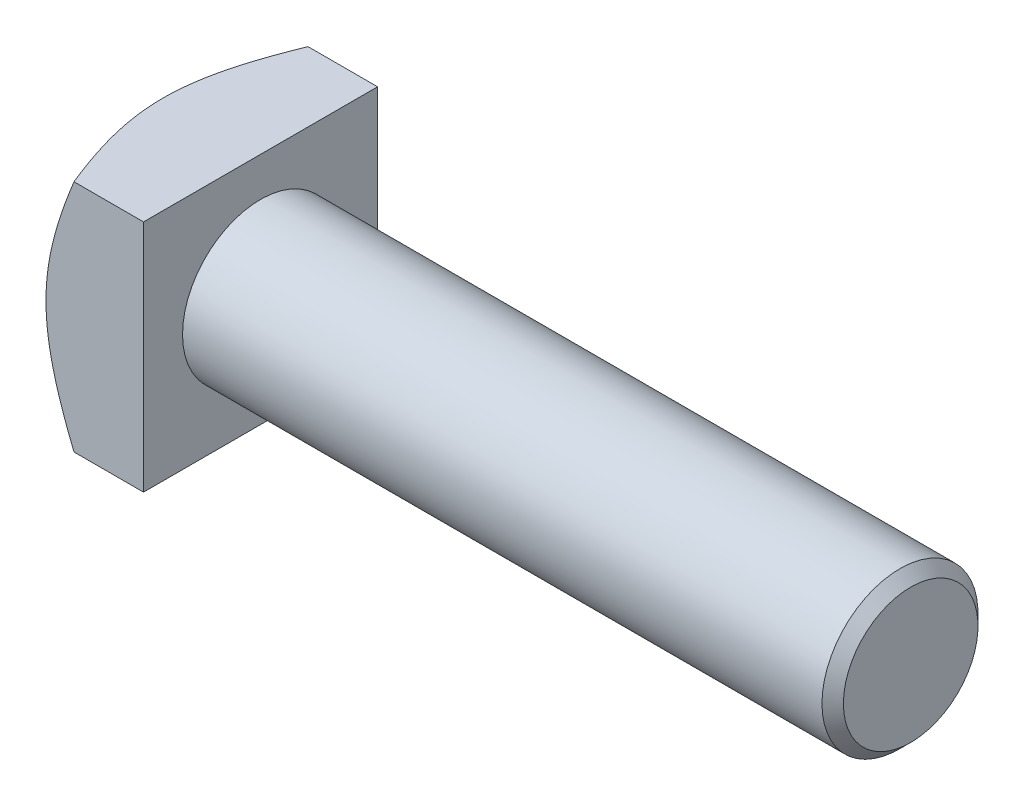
from build123d import *

# Parameters (mm, degrees)
SKETCH1_W      = 36
SKETCH1_H      = 36
BASEHEAD_DEPTH = 15


with BuildPart() as part:
    # Sketch1 → BaseHead (new body)
    with BuildSketch(Plane(origin=(0, 0, 0), x_dir=(0, 0, -1), z_dir=(1, 0, 0))):
        Rectangle(SKETCH1_W, SKETCH1_H)
    extrude(amount=BASEHEAD_DEPTH)

    # BodySke → BaseBody (revolve)
    with BuildSketch(Plane.XY, mode=Mode.PRIVATE) as basebody_sk:
        Polygon((0, 0), (115, 0), (115, 10.352), (113.352, 12), (0, 12), align=None)
    revolve(basebody_sk.sketch.rotate(Axis((0, 0, 0), (1, 0, 0)), 90), axis=Axis((0, 0, 0), (1, 0, 0)))

    # Sketch3 → HeadChamfer (revolve, cut)
    with BuildSketch(Plane.XY):
        Polygon((0, 18), (5.196152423, 27), (5.196152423, 28), (-1, 28), (-1, 18), align=None)
    revolve(axis=Axis((0, 0, 0), (1, 0, 0)), mode=Mode.SUBTRACT)


solid = part.part
